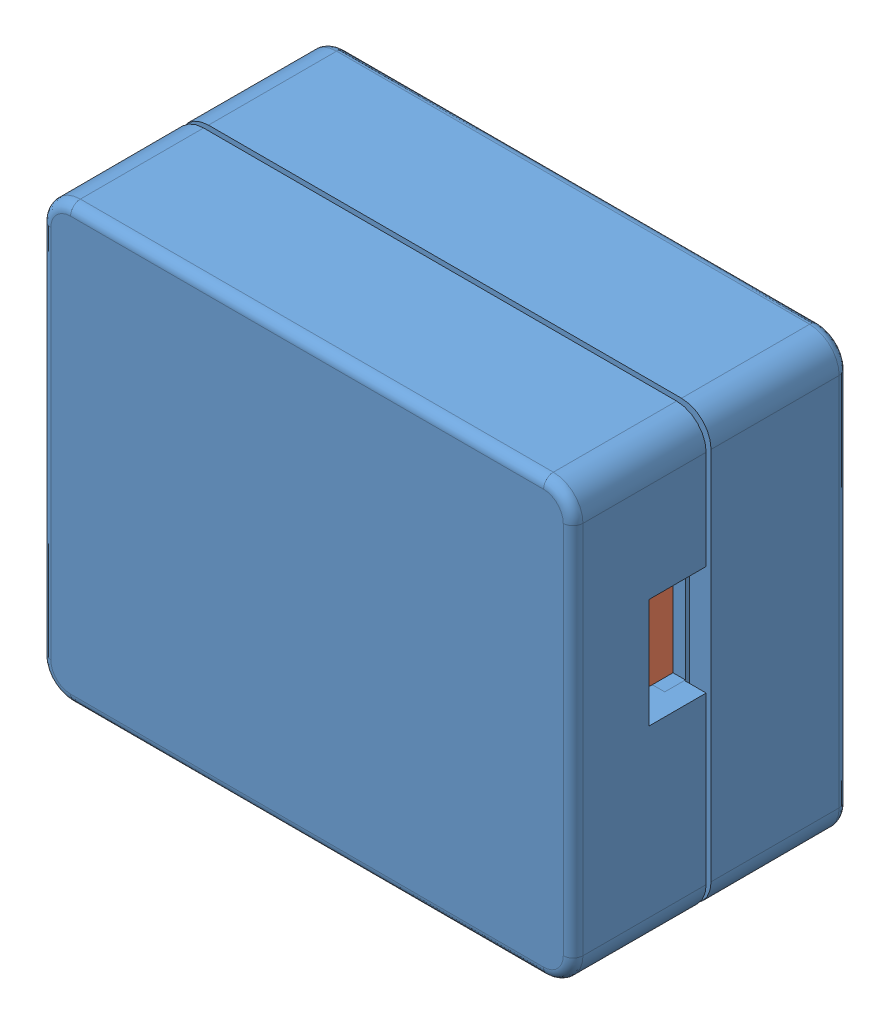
SolidWorks assembly Assem1.SLDASM, configuration Default (file format 8000). Lengths in mm.
Overall size (27.11 22 14).
2 component instances, 2 part files, 3 mates.
Components (placement in the parent):
- connector enclosure-1: connector enclosure.SLDPRT [Default] at (13.0691 11.5417 20.2184) size (27 22 14)
- connector board-1: connector board.SLDPRT [Default] at (13.0691 11.5417 20.4234) size (25.86 14 4.81)
Mates (geometry in assembly coordinates):
- Width1: width anti-aligned: plane of connector board-1 through (24.0691 18.5417 20.8984) normal (1 0 0); plane of connector board-1 through (2.0691 18.5417 20.8984) normal (-1 0 0); plane of connector enclosure-1 through (24.3691 22.5417 27.2184) normal (-1 0 0); plane of connector enclosure-1 through (1.7691 22.5417 27.2184) normal (1 0 0)
- Width2: width aligned: plane of connector board-1 through (2.0691 4.5417 20.8984) normal (0 -1 0); plane of connector board-1 through (2.0691 18.5417 20.8984) normal (0 1 0); plane of connector enclosure-1 through (26.5691 20.3417 27.2184) normal (0 -1 0); plane of connector enclosure-1 through (26.5691 2.7417 27.2184) normal (0 1 0)
- Coincident2: coincident anti-aligned: plane of connector enclosure-1 through (21.2941 7.3167 19.9484) normal (0 0 1); plane of connector board-1 through (13.0691 11.5417 19.9484) normal (0 0 -1)
